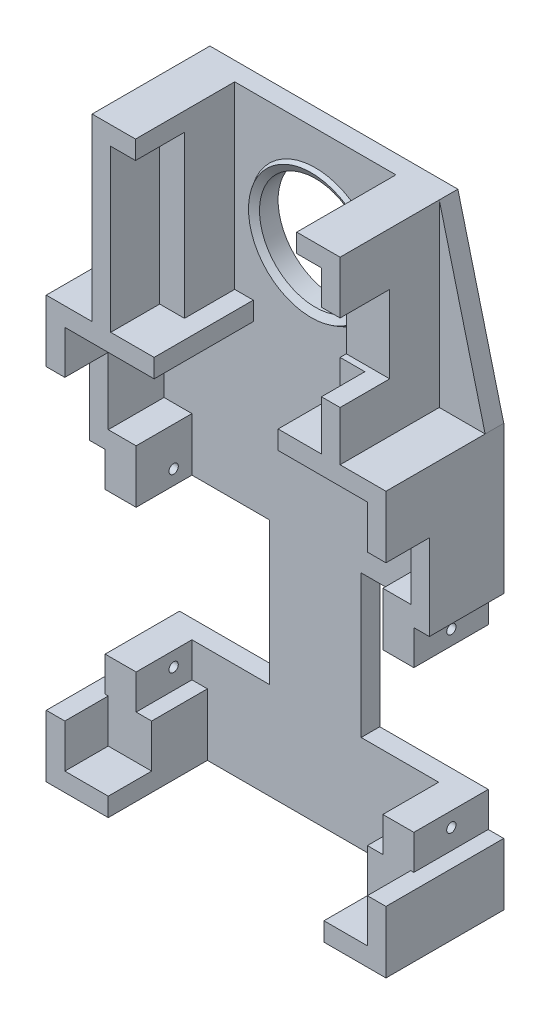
from build123d import *

# Parameters (mm, degrees)
ESQUISSE1_R             = 9
BOSS_EXTRU_1_DEPTH      = 3
BOSS_EXTRU_2_DEPTH      = 9
BOSS_EXTRU_3_DEPTH      = 16
ESQUISSE5_R             = 0.75
ENL_V_MAT_EXTRU_1_DEPTH = 55
ESQUISSE7_W             = 7
ESQUISSE7_H             = 12.5
ENL_V_MAT_EXTRU_2_DEPTH = 1
ESQUISSE9_W             = 4
ESQUISSE9_H             = 26
ENL_V_MAT_EXTRU_3_DEPTH = 0.9


with BuildPart() as part:
    # Esquisse1 → Boss.-Extru.1 (new body)
    with BuildSketch(Plane.XY):
        Polygon((-27.4, 0), (27.4, 0), (27.4, 10), (24.9, 10), (24.9, 15.6), (7.4, 15.6), (7.4, 38.6), (24.9, 38.6), (24.9, 44.2), (27.4, 44.2), (27.4, 68), (20, 97), (-20, 97), (-27.4, 68), (-27.4, 44.2), (-24.9, 44.2), (-24.9, 38.6), (-7.4, 38.6), (-7.4, 15.6), (-24.9, 15.6), (-24.9, 10), (-27.4, 10), align=None)
        with Locations((0, 81)):
            Circle(ESQUISSE1_R, mode=Mode.SUBTRACT)
    extrude(amount=BOSS_EXTRU_1_DEPTH)

    # Esquisse2 → Boss.-Extru.2 (add)
    with BuildSketch(Plane.XY.offset(3)):
        Polygon((-27.4, 68), (-20, 68), (-20, 97), (-13, 97), (-13, 65), (-17.4, 65), (-17.4, 58), (-24.4, 58), (-24.4, 47.2), (-19.9, 47.2), (-19.9, 38.6), (-24.9, 38.6), (-24.9, 44.2), (-27.4, 44.2), align=None)
        Polygon((27.4, 68), (20, 68), (20, 97), (13, 97), (13, 65), (17.4, 65), (17.4, 58), (24.4, 58), (24.4, 47.2), (19.9, 47.2), (19.9, 38.6), (24.9, 38.6), (24.9, 44.2), (27.4, 44.2), align=None)
        Polygon((-27.4, 0), (-17.4, 0), (-17.4, 10), (-19.9, 10), (-19.9, 15.6), (-24.9, 15.6), (-24.9, 10), (-27.4, 10), align=None)
        Polygon((27.4, 0), (17.4, 0), (17.4, 10), (19.9, 10), (19.9, 15.6), (24.9, 15.6), (24.9, 10), (27.4, 10), align=None)
    extrude(amount=BOSS_EXTRU_2_DEPTH)

    # Esquisse3 → Boss.-Extru.3 (add)
    with BuildSketch(Plane.XY.offset(3)):
        Polygon((-27.4, 0), (-27.4, 10), (-24.4, 10), (-24.4, 3), (-17.4, 3), (-17.4, 0), align=None)
        Polygon((27.4, 0), (27.4, 10), (24.4, 10), (24.4, 3), (17.4, 3), (17.4, 0), align=None)
        Polygon((-27.4, 68), (-20, 68), (-20, 97), (-13, 97), (-13, 94), (-17, 94), (-17, 68), (-10, 68), (-10, 65), (-24.4, 65), (-24.4, 58), (-27.4, 58), align=None)
        Polygon((20, 88.5), (20, 97), (13, 97), (13, 94), (17, 94), (17, 88.5), align=None)
        Polygon((24.4, 58), (27.4, 58), (27.4, 68), (20, 68), (20, 76), (17, 76), (17, 68), (10, 68), (10, 65), (24.4, 65), align=None)
    extrude(amount=BOSS_EXTRU_3_DEPTH)

    # Esquisse4 → R_volution1 (revolve)
    with BuildSketch(Plane(origin=(0, 0, 0), x_dir=(0, 0, -1), z_dir=(1, 0, 0)), mode=Mode.PRIVATE) as r_volution1_sk:
        Polygon((-3, 72), (-3.649519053, 70.875), (-3, 70.5), align=None)
    revolve(r_volution1_sk.sketch.rotate(Axis((0, 81, 8.573846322), (0, 0, -1)), 270), axis=Axis((0, 81, 8.573846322), (0, 0, -1)))

    # Esquisse5 → Enl_v. mat.-Extru.1 (cut, symmetric)
    with BuildSketch(Plane(origin=(0, 0, 0), x_dir=(0, 0, -1), z_dir=(1, 0, 0))):
        with Locations((-5.95, 40.95)):
            Circle(ESQUISSE5_R)
        with Locations((-5.95, 13.25)):
            Circle(ESQUISSE5_R)
    extrude(amount=ENL_V_MAT_EXTRU_1_DEPTH, both=True, mode=Mode.SUBTRACT)

    # Esquisse7 → Enl_v. mat.-Extru.2 (cut)
    with BuildSketch(Plane.XY.offset(12)):
        with Locations((16.5, 82.25)):
            Rectangle(ESQUISSE7_W, ESQUISSE7_H)
    extrude(amount=-ENL_V_MAT_EXTRU_2_DEPTH, mode=Mode.SUBTRACT)

    # Esquisse9 → Enl_v. mat.-Extru.3 (cut)
    with BuildSketch(Plane.XY.offset(12)):
        with Locations((-15, 81)):
            Rectangle(ESQUISSE9_W, ESQUISSE9_H)
    extrude(amount=-ENL_V_MAT_EXTRU_3_DEPTH, mode=Mode.SUBTRACT)


solid = part.part
